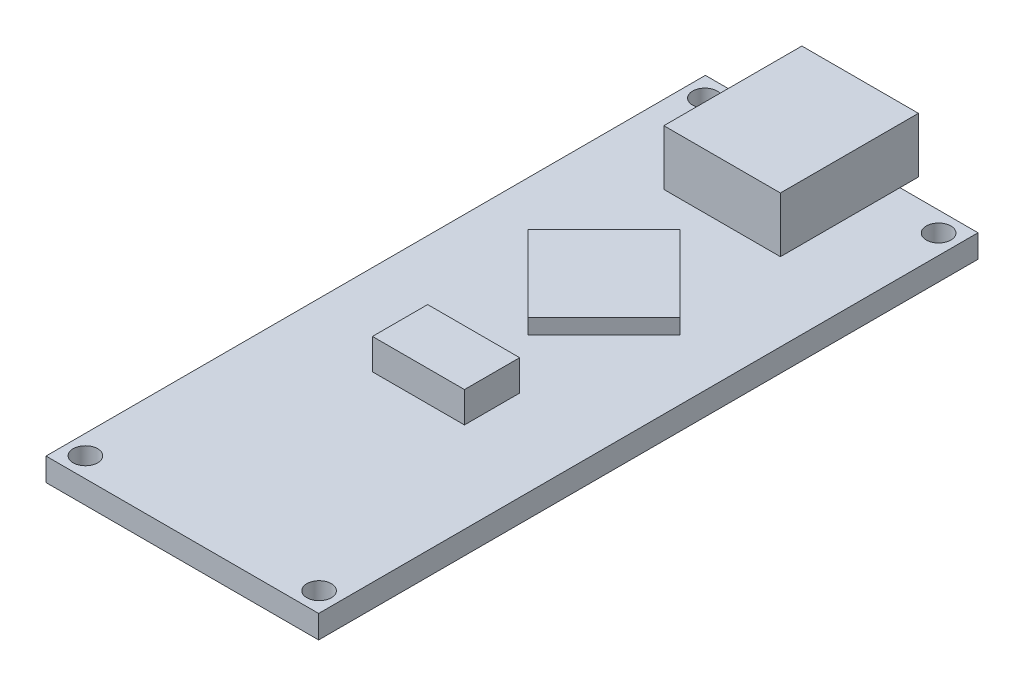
from build123d import *

# Parameters (mm, degrees)
SKETCH1_W           = 17.78
SKETCH1_H           = 43
BOSS_EXTRUDE1_DEPTH = 1.5
SKETCH2_R           = 0.8
CUT_EXTRUDE1_DEPTH  = 1.5
BOSS_EXTRUDE2_DEPTH = 1
SKETCH4_W           = 7.6
SKETCH4_H           = 9
BOSS_EXTRUDE3_DEPTH = 3.6
SKETCH5_W           = 6
SKETCH5_H           = 3.6
BOSS_EXTRUDE4_DEPTH = 2
SKETCH6_W           = 11.025356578
SKETCH6_H           = 4.290949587
BOSS_EXTRUDE5_DEPTH = 1
SKETCH7_W           = 6.73440699
SKETCH7_H           = 12.753655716
BOSS_EXTRUDE6_DEPTH = 1


with BuildPart() as part:
    # Sketch1 → Boss-Extrude1 (new body)
    with BuildSketch(Plane(origin=(0, 0, 0), x_dir=(1, 0, 0), z_dir=(0, 1, 0))):
        Rectangle(SKETCH1_W, SKETCH1_H)
    extrude(amount=BOSS_EXTRUDE1_DEPTH)

    # Sketch2 → Cut-Extrude1 (cut)
    with BuildSketch(Plane(origin=(0, 1.5, 0), x_dir=(1, 0, 0), z_dir=(0, 1, 0))):
        with Locations(Location((-7.62, 20.2, 0), (0, 0, 270))):
            Circle(SKETCH2_R)
        with Locations(Location((7.62, 20.2, 0), (0, 0, 270))):
            Circle(SKETCH2_R)
        with Locations(Location((7.62, -20.2, 0), (0, 0, 270))):
            Circle(SKETCH2_R)
        with Locations(Location((-7.62, -20.2, 0), (0, 0, 270))):
            Circle(SKETCH2_R)
    extrude(amount=-CUT_EXTRUDE1_DEPTH, mode=Mode.SUBTRACT)

    # Sketch3 → Boss-Extrude2 (add)
    with BuildSketch(Plane(origin=(0, 1.5, 0), x_dir=(1, 0, 0), z_dir=(0, 1, 0))):
        Polygon((-4.949747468, 6), (0, 10.949747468), (4.949747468, 6), (0, 1.050252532), align=None)
    extrude(amount=BOSS_EXTRUDE2_DEPTH)

    # Sketch4 → Boss-Extrude3 (add)
    with BuildSketch(Plane(origin=(0, 1.5, 0), x_dir=(1, 0, 0), z_dir=(0, 1, 0))):
        with Locations((0, 18.203721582)):
            Rectangle(SKETCH4_W, SKETCH4_H)
    extrude(amount=BOSS_EXTRUDE3_DEPTH)

    # Sketch5 → Boss-Extrude4 (add)
    with BuildSketch(Plane(origin=(0, 1.5, 0), x_dir=(1, 0, 0), z_dir=(0, 1, 0))):
        with Locations((0, -4.3)):
            Rectangle(SKETCH5_W, SKETCH5_H)
    extrude(amount=BOSS_EXTRUDE4_DEPTH)

    # Sketch6 → Boss-Extrude5 (add)
    with BuildSketch(Plane.XZ):
        with Locations((0, 13.880094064)):
            Rectangle(SKETCH6_W, SKETCH6_H)
    extrude(amount=BOSS_EXTRUDE5_DEPTH)

    # Sketch7 → Boss-Extrude6 (add)
    with BuildSketch(Plane.XZ):
        with Locations((0, -9.958514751)):
            Rectangle(SKETCH7_W, SKETCH7_H)
    extrude(amount=BOSS_EXTRUDE6_DEPTH)


solid = part.part
